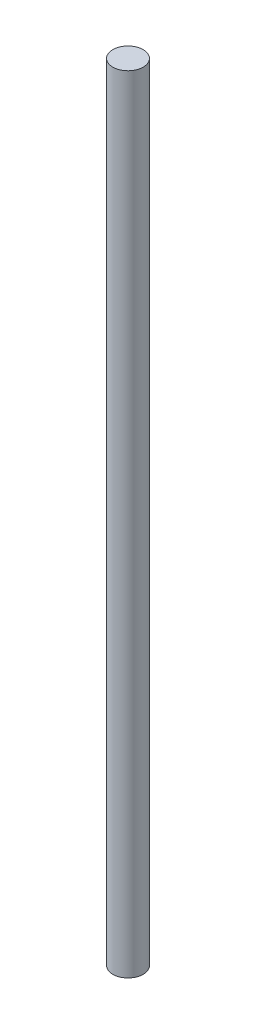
ISO-10303-21;
HEADER;
FILE_DESCRIPTION(('STEP AP214'),'2;1');
FILE_NAME('part.step','',(''),(''),'','','');
FILE_SCHEMA(('AUTOMOTIVE_DESIGN { 1 0 10303 214 1 1 1 1 }'));
ENDSEC;
DATA;
#1=APPLICATION_CONTEXT('core data for automotive mechanical design processes');
#2=APPLICATION_PROTOCOL_DEFINITION('international standard','automotive_design',2000,#1);
#3=PRODUCT_CONTEXT('',#1,'mechanical');
#4=PRODUCT('Part','Part','',(#3));
#5=PRODUCT_RELATED_PRODUCT_CATEGORY('part','',(#4));
#6=PRODUCT_DEFINITION_FORMATION('','',#4);
#7=PRODUCT_DEFINITION_CONTEXT('part definition',#1,'design');
#8=PRODUCT_DEFINITION('design','',#6,#7);
#9=PRODUCT_DEFINITION_SHAPE('','',#8);
#10=(LENGTH_UNIT() NAMED_UNIT(*) SI_UNIT(.MILLI.,.METRE.));
#11=(NAMED_UNIT(*) PLANE_ANGLE_UNIT() SI_UNIT($,.RADIAN.));
#12=(NAMED_UNIT(*) SI_UNIT($,.STERADIAN.) SOLID_ANGLE_UNIT());
#13=UNCERTAINTY_MEASURE_WITH_UNIT(LENGTH_MEASURE(1.E-05),#10,'distance_accuracy_value','');
#14=(GEOMETRIC_REPRESENTATION_CONTEXT(3) GLOBAL_UNCERTAINTY_ASSIGNED_CONTEXT((#13)) GLOBAL_UNIT_ASSIGNED_CONTEXT((#10,
#11,#12)) REPRESENTATION_CONTEXT('',''));
#15=CARTESIAN_POINT('',(0.,0.,0.));
#16=DIRECTION('',(0.,0.,1.));
#17=DIRECTION('',(1.,0.,0.));
#18=AXIS2_PLACEMENT_3D('',#15,#16,#17);
#19=CARTESIAN_POINT('',(0.,207.,0.));
#20=DIRECTION('',(0.,1.,0.));
#21=DIRECTION('',(0.,0.,1.));
#22=AXIS2_PLACEMENT_3D('',#19,#20,#21);
#23=PLANE('',#22);
#24=CARTESIAN_POINT('',(0.,207.,0.));
#25=DIRECTION('',(0.,-1.,0.));
#26=DIRECTION('',(0.,0.,-1.));
#27=AXIS2_PLACEMENT_3D('',#24,#25,#26);
#28=CIRCLE('',#27,4.);
#29=CARTESIAN_POINT('',(0.,207.,-4.));
#30=VERTEX_POINT('',#29);
#31=EDGE_CURVE('E18',#30,#30,#28,.T.);
#32=ORIENTED_EDGE('',*,*,#31,.F.);
#33=EDGE_LOOP('',(#32));
#34=FACE_BOUND('',#33,.T.);
#35=ADVANCED_FACE('F15',(#34),#23,.T.);
#36=CARTESIAN_POINT('',(0.,0.,0.));
#37=DIRECTION('',(0.,1.,0.));
#38=DIRECTION('',(0.,0.,1.));
#39=AXIS2_PLACEMENT_3D('',#36,#37,#38);
#40=PLANE('',#39);
#41=CARTESIAN_POINT('',(0.,0.,0.));
#42=DIRECTION('',(0.,-1.,0.));
#43=DIRECTION('',(0.,0.,-1.));
#44=AXIS2_PLACEMENT_3D('',#41,#42,#43);
#45=CIRCLE('',#44,4.);
#46=CARTESIAN_POINT('',(0.,0.,-4.));
#47=VERTEX_POINT('',#46);
#48=EDGE_CURVE('E10',#47,#47,#45,.F.);
#49=ORIENTED_EDGE('',*,*,#48,.F.);
#50=EDGE_LOOP('',(#49));
#51=FACE_BOUND('',#50,.T.);
#52=ADVANCED_FACE('F30',(#51),#40,.F.);
#53=CARTESIAN_POINT('',(0.,369.,0.));
#54=DIRECTION('',(0.,-1.,0.));
#55=DIRECTION('',(0.,0.,-1.));
#56=AXIS2_PLACEMENT_3D('',#53,#54,#55);
#57=CYLINDRICAL_SURFACE('',#56,4.);
#58=ORIENTED_EDGE('',*,*,#48,.T.);
#59=EDGE_LOOP('',(#58));
#60=FACE_BOUND('',#59,.T.);
#61=ORIENTED_EDGE('',*,*,#31,.T.);
#62=EDGE_LOOP('',(#61));
#63=FACE_BOUND('',#62,.T.);
#64=ADVANCED_FACE('F27',(#60,#63),#57,.T.);
#65=CLOSED_SHELL('',(#35,#52,#64));
#66=MANIFOLD_SOLID_BREP('B1',#65);
#67=ADVANCED_BREP_SHAPE_REPRESENTATION('',(#18,#66),#14);
#68=SHAPE_DEFINITION_REPRESENTATION(#9,#67);
ENDSEC;
END-ISO-10303-21;
